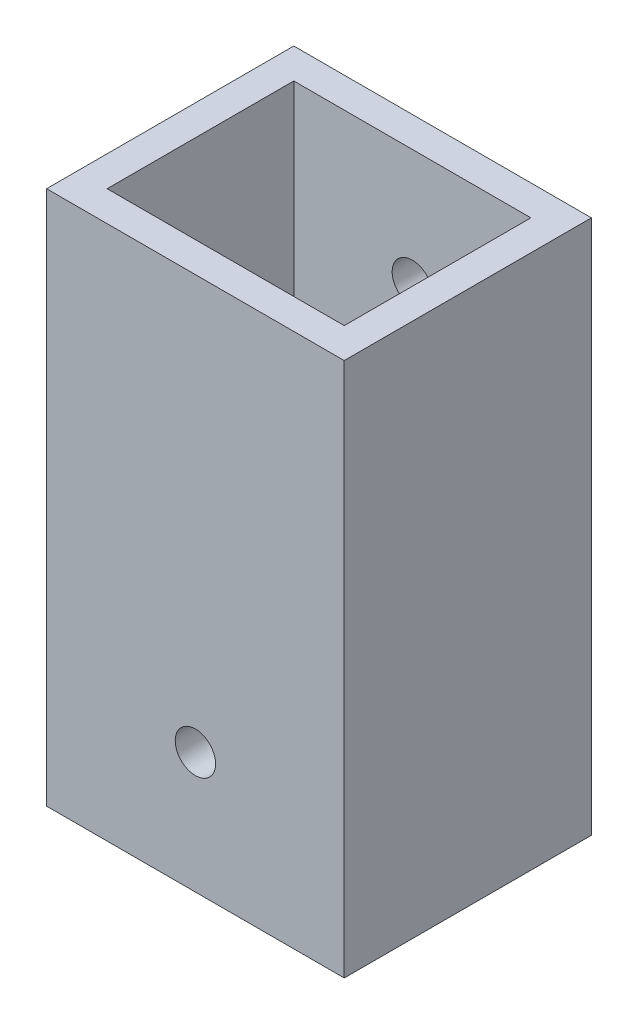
ISO-10303-21;
HEADER;
FILE_DESCRIPTION(('STEP AP214'),'2;1');
FILE_NAME('part.step','',(''),(''),'','','');
FILE_SCHEMA(('AUTOMOTIVE_DESIGN { 1 0 10303 214 1 1 1 1 }'));
ENDSEC;
DATA;
#1=APPLICATION_CONTEXT('core data for automotive mechanical design processes');
#2=APPLICATION_PROTOCOL_DEFINITION('international standard','automotive_design',2000,#1);
#3=PRODUCT_CONTEXT('',#1,'mechanical');
#4=PRODUCT('Part','Part','',(#3));
#5=PRODUCT_RELATED_PRODUCT_CATEGORY('part','',(#4));
#6=PRODUCT_DEFINITION_FORMATION('','',#4);
#7=PRODUCT_DEFINITION_CONTEXT('part definition',#1,'design');
#8=PRODUCT_DEFINITION('design','',#6,#7);
#9=PRODUCT_DEFINITION_SHAPE('','',#8);
#10=(LENGTH_UNIT() NAMED_UNIT(*) SI_UNIT(.MILLI.,.METRE.));
#11=(NAMED_UNIT(*) PLANE_ANGLE_UNIT() SI_UNIT($,.RADIAN.));
#12=(NAMED_UNIT(*) SI_UNIT($,.STERADIAN.) SOLID_ANGLE_UNIT());
#13=UNCERTAINTY_MEASURE_WITH_UNIT(LENGTH_MEASURE(1.E-05),#10,'distance_accuracy_value','');
#14=(GEOMETRIC_REPRESENTATION_CONTEXT(3) GLOBAL_UNCERTAINTY_ASSIGNED_CONTEXT((#13)) GLOBAL_UNIT_ASSIGNED_CONTEXT((#10,
#11,#12)) REPRESENTATION_CONTEXT('',''));
#15=CARTESIAN_POINT('',(0.,0.,0.));
#16=DIRECTION('',(0.,0.,1.));
#17=DIRECTION('',(1.,0.,0.));
#18=AXIS2_PLACEMENT_3D('',#15,#16,#17);
#19=CARTESIAN_POINT('',(0.,50.,0.));
#20=DIRECTION('',(0.,1.,0.));
#21=DIRECTION('',(0.,0.,1.));
#22=AXIS2_PLACEMENT_3D('',#19,#20,#21);
#23=PLANE('',#22);
#24=DIRECTION('',(0.,0.,1.));
#25=VECTOR('',#24,1.);
#26=CARTESIAN_POINT('',(-14.75,50.,-12.25));
#27=LINE('',#26,#25);
#28=CARTESIAN_POINT('',(-14.75,50.,-12.25));
#29=VERTEX_POINT('',#28);
#30=CARTESIAN_POINT('',(-14.75,50.,12.25));
#31=VERTEX_POINT('',#30);
#32=EDGE_CURVE('E105',#29,#31,#27,.T.);
#33=ORIENTED_EDGE('',*,*,#32,.T.);
#34=DIRECTION('',(1.,0.,0.));
#35=VECTOR('',#34,1.);
#36=CARTESIAN_POINT('',(-14.75,50.,12.25));
#37=LINE('',#36,#35);
#38=CARTESIAN_POINT('',(14.75,50.,12.25));
#39=VERTEX_POINT('',#38);
#40=EDGE_CURVE('E164',#31,#39,#37,.T.);
#41=ORIENTED_EDGE('',*,*,#40,.T.);
#42=DIRECTION('',(0.,0.,-1.));
#43=VECTOR('',#42,1.);
#44=CARTESIAN_POINT('',(14.75,50.,-12.25));
#45=LINE('',#44,#43);
#46=CARTESIAN_POINT('',(14.75,50.,-12.25));
#47=VERTEX_POINT('',#46);
#48=EDGE_CURVE('E166',#39,#47,#45,.T.);
#49=ORIENTED_EDGE('',*,*,#48,.T.);
#50=DIRECTION('',(-1.,0.,0.));
#51=VECTOR('',#50,1.);
#52=CARTESIAN_POINT('',(-14.75,50.,-12.25));
#53=LINE('',#52,#51);
#54=EDGE_CURVE('E58',#47,#29,#53,.T.);
#55=ORIENTED_EDGE('',*,*,#54,.T.);
#56=EDGE_LOOP('',(#33,#41,#49,#55));
#57=FACE_BOUND('',#56,.T.);
#58=DIRECTION('',(-1.,0.,0.));
#59=VECTOR('',#58,1.);
#60=CARTESIAN_POINT('',(-11.75,50.,-9.25));
#61=LINE('',#60,#59);
#62=CARTESIAN_POINT('',(11.75,50.,-9.25));
#63=VERTEX_POINT('',#62);
#64=CARTESIAN_POINT('',(-11.75,50.,-9.25));
#65=VERTEX_POINT('',#64);
#66=EDGE_CURVE('E137',#63,#65,#61,.T.);
#67=ORIENTED_EDGE('',*,*,#66,.F.);
#68=DIRECTION('',(0.,0.,-1.));
#69=VECTOR('',#68,1.);
#70=CARTESIAN_POINT('',(11.75,50.,-9.25));
#71=LINE('',#70,#69);
#72=CARTESIAN_POINT('',(11.75,50.,9.25));
#73=VERTEX_POINT('',#72);
#74=EDGE_CURVE('E135',#73,#63,#71,.T.);
#75=ORIENTED_EDGE('',*,*,#74,.F.);
#76=DIRECTION('',(1.,0.,0.));
#77=VECTOR('',#76,1.);
#78=CARTESIAN_POINT('',(-11.75,50.,9.25));
#79=LINE('',#78,#77);
#80=CARTESIAN_POINT('',(-11.75,50.,9.25));
#81=VERTEX_POINT('',#80);
#82=EDGE_CURVE('E142',#81,#73,#79,.T.);
#83=ORIENTED_EDGE('',*,*,#82,.F.);
#84=DIRECTION('',(0.,0.,1.));
#85=VECTOR('',#84,1.);
#86=CARTESIAN_POINT('',(-11.75,50.,-9.25));
#87=LINE('',#86,#85);
#88=EDGE_CURVE('E140',#65,#81,#87,.T.);
#89=ORIENTED_EDGE('',*,*,#88,.F.);
#90=EDGE_LOOP('',(#67,#75,#83,#89));
#91=FACE_BOUND('',#90,.T.);
#92=ADVANCED_FACE('F33',(#57,#91),#23,.T.);
#93=CARTESIAN_POINT('',(-14.75,50.,-12.25));
#94=DIRECTION('',(1.,0.,0.));
#95=DIRECTION('',(0.,0.,-1.));
#96=AXIS2_PLACEMENT_3D('',#93,#94,#95);
#97=PLANE('',#96);
#98=DIRECTION('',(0.,-1.,0.));
#99=VECTOR('',#98,1.);
#100=CARTESIAN_POINT('',(-14.75,50.,-12.25));
#101=LINE('',#100,#99);
#102=CARTESIAN_POINT('',(-14.75,-3.,-12.25));
#103=VERTEX_POINT('',#102);
#104=EDGE_CURVE('E100',#29,#103,#101,.T.);
#105=ORIENTED_EDGE('',*,*,#104,.T.);
#106=DIRECTION('',(0.,0.,-1.));
#107=VECTOR('',#106,1.);
#108=CARTESIAN_POINT('',(-14.75,-3.,12.25));
#109=LINE('',#108,#107);
#110=CARTESIAN_POINT('',(-14.75,-3.,12.25));
#111=VERTEX_POINT('',#110);
#112=EDGE_CURVE('E104',#111,#103,#109,.T.);
#113=ORIENTED_EDGE('',*,*,#112,.F.);
#114=DIRECTION('',(0.,-1.,0.));
#115=VECTOR('',#114,1.);
#116=CARTESIAN_POINT('',(-14.75,50.,12.25));
#117=LINE('',#116,#115);
#118=EDGE_CURVE('E11',#31,#111,#117,.T.);
#119=ORIENTED_EDGE('',*,*,#118,.F.);
#120=ORIENTED_EDGE('',*,*,#32,.F.);
#121=EDGE_LOOP('',(#105,#113,#119,#120));
#122=FACE_BOUND('',#121,.T.);
#123=ADVANCED_FACE('F35',(#122),#97,.F.);
#124=CARTESIAN_POINT('',(-14.75,50.,12.25));
#125=DIRECTION('',(0.,0.,-1.));
#126=DIRECTION('',(-1.,0.,0.));
#127=AXIS2_PLACEMENT_3D('',#124,#125,#126);
#128=PLANE('',#127);
#129=CARTESIAN_POINT('',(0.,9.,12.25));
#130=DIRECTION('',(0.,0.,-1.));
#131=DIRECTION('',(-1.,0.,0.));
#132=AXIS2_PLACEMENT_3D('',#129,#130,#131);
#133=CIRCLE('',#132,2.);
#134=CARTESIAN_POINT('',(-2.,9.,12.25));
#135=VERTEX_POINT('',#134);
#136=EDGE_CURVE('E122',#135,#135,#133,.T.);
#137=ORIENTED_EDGE('',*,*,#136,.T.);
#138=EDGE_LOOP('',(#137));
#139=FACE_BOUND('',#138,.T.);
#140=ORIENTED_EDGE('',*,*,#118,.T.);
#141=DIRECTION('',(-1.,0.,0.));
#142=VECTOR('',#141,1.);
#143=CARTESIAN_POINT('',(-14.75,-3.,12.25));
#144=LINE('',#143,#142);
#145=CARTESIAN_POINT('',(14.75,-3.,12.25));
#146=VERTEX_POINT('',#145);
#147=EDGE_CURVE('E121',#146,#111,#144,.T.);
#148=ORIENTED_EDGE('',*,*,#147,.F.);
#149=DIRECTION('',(0.,-1.,0.));
#150=VECTOR('',#149,1.);
#151=CARTESIAN_POINT('',(14.75,50.,12.25));
#152=LINE('',#151,#150);
#153=EDGE_CURVE('E42',#39,#146,#152,.T.);
#154=ORIENTED_EDGE('',*,*,#153,.F.);
#155=ORIENTED_EDGE('',*,*,#40,.F.);
#156=EDGE_LOOP('',(#140,#148,#154,#155));
#157=FACE_BOUND('',#156,.T.);
#158=ADVANCED_FACE('F210',(#139,#157),#128,.F.);
#159=CARTESIAN_POINT('',(14.75,50.,-12.25));
#160=DIRECTION('',(-1.,0.,0.));
#161=DIRECTION('',(0.,0.,1.));
#162=AXIS2_PLACEMENT_3D('',#159,#160,#161);
#163=PLANE('',#162);
#164=ORIENTED_EDGE('',*,*,#153,.T.);
#165=DIRECTION('',(0.,0.,1.));
#166=VECTOR('',#165,1.);
#167=CARTESIAN_POINT('',(14.75,-3.,12.25));
#168=LINE('',#167,#166);
#169=CARTESIAN_POINT('',(14.75,-3.,-12.25));
#170=VERTEX_POINT('',#169);
#171=EDGE_CURVE('E116',#170,#146,#168,.T.);
#172=ORIENTED_EDGE('',*,*,#171,.F.);
#173=DIRECTION('',(0.,-1.,0.));
#174=VECTOR('',#173,1.);
#175=CARTESIAN_POINT('',(14.75,50.,-12.25));
#176=LINE('',#175,#174);
#177=EDGE_CURVE('E107',#47,#170,#176,.T.);
#178=ORIENTED_EDGE('',*,*,#177,.F.);
#179=ORIENTED_EDGE('',*,*,#48,.F.);
#180=EDGE_LOOP('',(#164,#172,#178,#179));
#181=FACE_BOUND('',#180,.T.);
#182=ADVANCED_FACE('F215',(#181),#163,.F.);
#183=CARTESIAN_POINT('',(-14.75,50.,-12.25));
#184=DIRECTION('',(0.,0.,1.));
#185=DIRECTION('',(1.,0.,0.));
#186=AXIS2_PLACEMENT_3D('',#183,#184,#185);
#187=PLANE('',#186);
#188=CARTESIAN_POINT('',(0.,9.,-12.25));
#189=DIRECTION('',(0.,0.,-1.));
#190=DIRECTION('',(-1.,0.,0.));
#191=AXIS2_PLACEMENT_3D('',#188,#189,#190);
#192=CIRCLE('',#191,2.);
#193=CARTESIAN_POINT('',(-2.,9.,-12.25));
#194=VERTEX_POINT('',#193);
#195=EDGE_CURVE('E334',#194,#194,#192,.T.);
#196=ORIENTED_EDGE('',*,*,#195,.F.);
#197=EDGE_LOOP('',(#196));
#198=FACE_BOUND('',#197,.T.);
#199=CARTESIAN_POINT('',(0.,38.5,-12.25));
#200=DIRECTION('',(0.,0.,-1.));
#201=DIRECTION('',(-1.,0.,0.));
#202=AXIS2_PLACEMENT_3D('',#199,#200,#201);
#203=CIRCLE('',#202,2.);
#204=CARTESIAN_POINT('',(-2.,38.5,-12.25));
#205=VERTEX_POINT('',#204);
#206=EDGE_CURVE('E131',#205,#205,#203,.T.);
#207=ORIENTED_EDGE('',*,*,#206,.F.);
#208=EDGE_LOOP('',(#207));
#209=FACE_BOUND('',#208,.T.);
#210=ORIENTED_EDGE('',*,*,#177,.T.);
#211=DIRECTION('',(1.,0.,0.));
#212=VECTOR('',#211,1.);
#213=CARTESIAN_POINT('',(-14.75,-3.,-12.25));
#214=LINE('',#213,#212);
#215=EDGE_CURVE('E110',#103,#170,#214,.T.);
#216=ORIENTED_EDGE('',*,*,#215,.F.);
#217=ORIENTED_EDGE('',*,*,#104,.F.);
#218=ORIENTED_EDGE('',*,*,#54,.F.);
#219=EDGE_LOOP('',(#210,#216,#217,#218));
#220=FACE_BOUND('',#219,.T.);
#221=ADVANCED_FACE('F111',(#198,#209,#220),#187,.F.);
#222=CARTESIAN_POINT('',(11.75,50.,-9.25));
#223=DIRECTION('',(-1.,0.,0.));
#224=DIRECTION('',(0.,0.,1.));
#225=AXIS2_PLACEMENT_3D('',#222,#223,#224);
#226=PLANE('',#225);
#227=DIRECTION('',(0.,0.,-1.));
#228=VECTOR('',#227,1.);
#229=CARTESIAN_POINT('',(11.75,0.,-9.25));
#230=LINE('',#229,#228);
#231=CARTESIAN_POINT('',(11.75,0.,9.25));
#232=VERTEX_POINT('',#231);
#233=CARTESIAN_POINT('',(11.75,0.,-9.25));
#234=VERTEX_POINT('',#233);
#235=EDGE_CURVE('E145',#232,#234,#230,.T.);
#236=ORIENTED_EDGE('',*,*,#235,.F.);
#237=DIRECTION('',(0.,-1.,0.));
#238=VECTOR('',#237,1.);
#239=CARTESIAN_POINT('',(11.75,50.,9.25));
#240=LINE('',#239,#238);
#241=EDGE_CURVE('E144',#73,#232,#240,.T.);
#242=ORIENTED_EDGE('',*,*,#241,.F.);
#243=ORIENTED_EDGE('',*,*,#74,.T.);
#244=DIRECTION('',(0.,-1.,0.));
#245=VECTOR('',#244,1.);
#246=CARTESIAN_POINT('',(11.75,50.,-9.25));
#247=LINE('',#246,#245);
#248=EDGE_CURVE('E160',#63,#234,#247,.T.);
#249=ORIENTED_EDGE('',*,*,#248,.T.);
#250=EDGE_LOOP('',(#236,#242,#243,#249));
#251=FACE_BOUND('',#250,.T.);
#252=ADVANCED_FACE('F180',(#251),#226,.T.);
#253=CARTESIAN_POINT('',(-11.75,50.,-9.25));
#254=DIRECTION('',(0.,0.,1.));
#255=DIRECTION('',(1.,0.,0.));
#256=AXIS2_PLACEMENT_3D('',#253,#254,#255);
#257=PLANE('',#256);
#258=CARTESIAN_POINT('',(0.,9.,-9.25));
#259=DIRECTION('',(0.,0.,1.));
#260=DIRECTION('',(1.,0.,0.));
#261=AXIS2_PLACEMENT_3D('',#258,#259,#260);
#262=CIRCLE('',#261,2.);
#263=CARTESIAN_POINT('',(2.,9.,-9.25));
#264=VERTEX_POINT('',#263);
#265=EDGE_CURVE('E125',#264,#264,#262,.T.);
#266=ORIENTED_EDGE('',*,*,#265,.F.);
#267=EDGE_LOOP('',(#266));
#268=FACE_BOUND('',#267,.T.);
#269=CARTESIAN_POINT('',(0.,38.5,-9.25));
#270=DIRECTION('',(0.,0.,1.));
#271=DIRECTION('',(1.,0.,0.));
#272=AXIS2_PLACEMENT_3D('',#269,#270,#271);
#273=CIRCLE('',#272,2.);
#274=CARTESIAN_POINT('',(2.,38.5,-9.25));
#275=VERTEX_POINT('',#274);
#276=EDGE_CURVE('E134',#275,#275,#273,.T.);
#277=ORIENTED_EDGE('',*,*,#276,.F.);
#278=EDGE_LOOP('',(#277));
#279=FACE_BOUND('',#278,.T.);
#280=DIRECTION('',(-1.,0.,0.));
#281=VECTOR('',#280,1.);
#282=CARTESIAN_POINT('',(-11.75,0.,-9.25));
#283=LINE('',#282,#281);
#284=CARTESIAN_POINT('',(-11.75,0.,-9.25));
#285=VERTEX_POINT('',#284);
#286=EDGE_CURVE('E148',#234,#285,#283,.T.);
#287=ORIENTED_EDGE('',*,*,#286,.F.);
#288=ORIENTED_EDGE('',*,*,#248,.F.);
#289=ORIENTED_EDGE('',*,*,#66,.T.);
#290=DIRECTION('',(0.,-1.,0.));
#291=VECTOR('',#290,1.);
#292=CARTESIAN_POINT('',(-11.75,50.,-9.25));
#293=LINE('',#292,#291);
#294=EDGE_CURVE('E158',#65,#285,#293,.T.);
#295=ORIENTED_EDGE('',*,*,#294,.T.);
#296=EDGE_LOOP('',(#287,#288,#289,#295));
#297=FACE_BOUND('',#296,.T.);
#298=ADVANCED_FACE('F176',(#268,#279,#297),#257,.T.);
#299=CARTESIAN_POINT('',(-11.75,50.,-9.25));
#300=DIRECTION('',(1.,0.,0.));
#301=DIRECTION('',(0.,0.,-1.));
#302=AXIS2_PLACEMENT_3D('',#299,#300,#301);
#303=PLANE('',#302);
#304=DIRECTION('',(0.,0.,1.));
#305=VECTOR('',#304,1.);
#306=CARTESIAN_POINT('',(-11.75,0.,-9.25));
#307=LINE('',#306,#305);
#308=CARTESIAN_POINT('',(-11.75,0.,9.25));
#309=VERTEX_POINT('',#308);
#310=EDGE_CURVE('E151',#285,#309,#307,.T.);
#311=ORIENTED_EDGE('',*,*,#310,.F.);
#312=ORIENTED_EDGE('',*,*,#294,.F.);
#313=ORIENTED_EDGE('',*,*,#88,.T.);
#314=DIRECTION('',(0.,-1.,0.));
#315=VECTOR('',#314,1.);
#316=CARTESIAN_POINT('',(-11.75,50.,9.25));
#317=LINE('',#316,#315);
#318=EDGE_CURVE('E50',#81,#309,#317,.T.);
#319=ORIENTED_EDGE('',*,*,#318,.T.);
#320=EDGE_LOOP('',(#311,#312,#313,#319));
#321=FACE_BOUND('',#320,.T.);
#322=ADVANCED_FACE('F179',(#321),#303,.T.);
#323=CARTESIAN_POINT('',(-11.75,50.,9.25));
#324=DIRECTION('',(0.,0.,-1.));
#325=DIRECTION('',(-1.,0.,0.));
#326=AXIS2_PLACEMENT_3D('',#323,#324,#325);
#327=PLANE('',#326);
#328=CARTESIAN_POINT('',(0.,9.,9.25));
#329=DIRECTION('',(0.,0.,-1.));
#330=DIRECTION('',(-1.,0.,0.));
#331=AXIS2_PLACEMENT_3D('',#328,#329,#330);
#332=CIRCLE('',#331,2.);
#333=CARTESIAN_POINT('',(-2.,9.,9.25));
#334=VERTEX_POINT('',#333);
#335=EDGE_CURVE('E37',#334,#334,#332,.T.);
#336=ORIENTED_EDGE('',*,*,#335,.F.);
#337=EDGE_LOOP('',(#336));
#338=FACE_BOUND('',#337,.T.);
#339=DIRECTION('',(1.,0.,0.));
#340=VECTOR('',#339,1.);
#341=CARTESIAN_POINT('',(-11.75,0.,9.25));
#342=LINE('',#341,#340);
#343=EDGE_CURVE('E138',#309,#232,#342,.T.);
#344=ORIENTED_EDGE('',*,*,#343,.F.);
#345=ORIENTED_EDGE('',*,*,#318,.F.);
#346=ORIENTED_EDGE('',*,*,#82,.T.);
#347=ORIENTED_EDGE('',*,*,#241,.T.);
#348=EDGE_LOOP('',(#344,#345,#346,#347));
#349=FACE_BOUND('',#348,.T.);
#350=ADVANCED_FACE('F193',(#338,#349),#327,.T.);
#351=CARTESIAN_POINT('',(0.,38.5,2.67));
#352=DIRECTION('',(0.,0.,-1.));
#353=DIRECTION('',(-1.,0.,0.));
#354=AXIS2_PLACEMENT_3D('',#351,#352,#353);
#355=CYLINDRICAL_SURFACE('',#354,2.);
#356=ORIENTED_EDGE('',*,*,#276,.T.);
#357=EDGE_LOOP('',(#356));
#358=FACE_BOUND('',#357,.T.);
#359=ORIENTED_EDGE('',*,*,#206,.T.);
#360=EDGE_LOOP('',(#359));
#361=FACE_BOUND('',#360,.T.);
#362=ADVANCED_FACE('F173',(#358,#361),#355,.F.);
#363=CARTESIAN_POINT('',(0.,0.,0.));
#364=DIRECTION('',(0.,-1.,0.));
#365=DIRECTION('',(0.,0.,-1.));
#366=AXIS2_PLACEMENT_3D('',#363,#364,#365);
#367=PLANE('',#366);
#368=ORIENTED_EDGE('',*,*,#235,.T.);
#369=ORIENTED_EDGE('',*,*,#286,.T.);
#370=ORIENTED_EDGE('',*,*,#310,.T.);
#371=ORIENTED_EDGE('',*,*,#343,.T.);
#372=EDGE_LOOP('',(#368,#369,#370,#371));
#373=FACE_BOUND('',#372,.T.);
#374=ADVANCED_FACE('F192',(#373),#367,.F.);
#375=CARTESIAN_POINT('',(0.,-3.,0.));
#376=DIRECTION('',(0.,-1.,0.));
#377=DIRECTION('',(0.,0.,-1.));
#378=AXIS2_PLACEMENT_3D('',#375,#376,#377);
#379=PLANE('',#378);
#380=ORIENTED_EDGE('',*,*,#112,.T.);
#381=ORIENTED_EDGE('',*,*,#215,.T.);
#382=ORIENTED_EDGE('',*,*,#171,.T.);
#383=ORIENTED_EDGE('',*,*,#147,.T.);
#384=EDGE_LOOP('',(#380,#381,#382,#383));
#385=FACE_BOUND('',#384,.T.);
#386=ADVANCED_FACE('F119',(#385),#379,.T.);
#387=CARTESIAN_POINT('',(0.,9.,15.75));
#388=DIRECTION('',(0.,0.,-1.));
#389=DIRECTION('',(-1.,0.,0.));
#390=AXIS2_PLACEMENT_3D('',#387,#388,#389);
#391=CYLINDRICAL_SURFACE('',#390,2.);
#392=ORIENTED_EDGE('',*,*,#335,.T.);
#393=EDGE_LOOP('',(#392));
#394=FACE_BOUND('',#393,.T.);
#395=ORIENTED_EDGE('',*,*,#136,.F.);
#396=EDGE_LOOP('',(#395));
#397=FACE_BOUND('',#396,.T.);
#398=ADVANCED_FACE('F228',(#394,#397),#391,.F.);
#399=ORIENTED_EDGE('',*,*,#265,.T.);
#400=EDGE_LOOP('',(#399));
#401=FACE_BOUND('',#400,.T.);
#402=ORIENTED_EDGE('',*,*,#195,.T.);
#403=EDGE_LOOP('',(#402));
#404=FACE_BOUND('',#403,.T.);
#405=ADVANCED_FACE('F230',(#401,#404),#391,.F.);
#406=CLOSED_SHELL('',(#92,#123,#158,#182,#221,#252,#298,#322,#350,#362,#374,#386,#398,#405));
#407=MANIFOLD_SOLID_BREP('B2',#406);
#408=ADVANCED_BREP_SHAPE_REPRESENTATION('',(#18,#407),#14);
#409=SHAPE_DEFINITION_REPRESENTATION(#9,#408);
ENDSEC;
END-ISO-10303-21;
